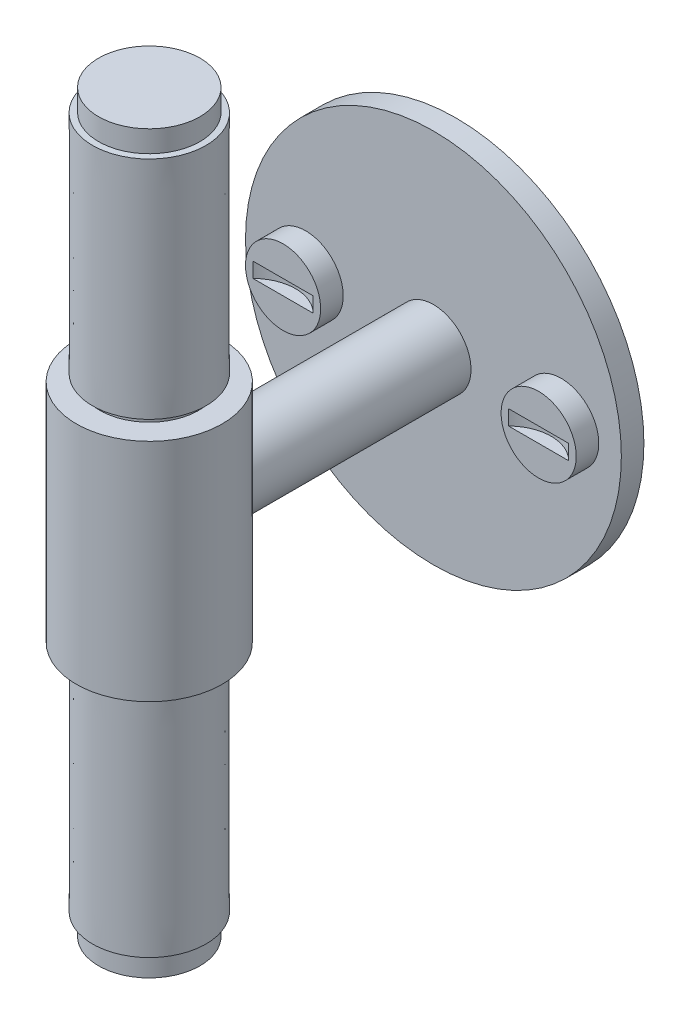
ISO-10303-21;
HEADER;
FILE_DESCRIPTION(('STEP AP214'),'2;1');
FILE_NAME('part.step','',(''),(''),'','','');
FILE_SCHEMA(('AUTOMOTIVE_DESIGN { 1 0 10303 214 1 1 1 1 }'));
ENDSEC;
DATA;
#1=APPLICATION_CONTEXT('core data for automotive mechanical design processes');
#2=APPLICATION_PROTOCOL_DEFINITION('international standard','automotive_design',2000,#1);
#3=PRODUCT_CONTEXT('',#1,'mechanical');
#4=PRODUCT('Part','Part','',(#3));
#5=PRODUCT_RELATED_PRODUCT_CATEGORY('part','',(#4));
#6=PRODUCT_DEFINITION_FORMATION('','',#4);
#7=PRODUCT_DEFINITION_CONTEXT('part definition',#1,'design');
#8=PRODUCT_DEFINITION('design','',#6,#7);
#9=PRODUCT_DEFINITION_SHAPE('','',#8);
#10=(LENGTH_UNIT() NAMED_UNIT(*) SI_UNIT(.MILLI.,.METRE.));
#11=(NAMED_UNIT(*) PLANE_ANGLE_UNIT() SI_UNIT($,.RADIAN.));
#12=(NAMED_UNIT(*) SI_UNIT($,.STERADIAN.) SOLID_ANGLE_UNIT());
#13=UNCERTAINTY_MEASURE_WITH_UNIT(LENGTH_MEASURE(1.E-05),#10,'distance_accuracy_value','');
#14=(GEOMETRIC_REPRESENTATION_CONTEXT(3) GLOBAL_UNCERTAINTY_ASSIGNED_CONTEXT((#13)) GLOBAL_UNIT_ASSIGNED_CONTEXT((#10,
#11,#12)) REPRESENTATION_CONTEXT('',''));
#15=CARTESIAN_POINT('',(0.,0.,0.));
#16=DIRECTION('',(0.,0.,1.));
#17=DIRECTION('',(1.,0.,0.));
#18=AXIS2_PLACEMENT_3D('',#15,#16,#17);
#19=CARTESIAN_POINT('',(0.,0.,-40.));
#20=DIRECTION('',(0.,0.,-1.));
#21=DIRECTION('',(-1.,0.,0.));
#22=AXIS2_PLACEMENT_3D('',#19,#20,#21);
#23=PLANE('',#22);
#24=CARTESIAN_POINT('',(-17.,0.,-40.));
#25=DIRECTION('',(0.,0.,-1.));
#26=DIRECTION('',(-1.,0.,0.));
#27=AXIS2_PLACEMENT_3D('',#24,#25,#26);
#28=CIRCLE('',#27,5.);
#29=CARTESIAN_POINT('',(-22.,0.,-40.));
#30=VERTEX_POINT('',#29);
#31=EDGE_CURVE('E89',#30,#30,#28,.T.);
#32=ORIENTED_EDGE('',*,*,#31,.T.);
#33=EDGE_LOOP('',(#32));
#34=FACE_BOUND('',#33,.T.);
#35=CARTESIAN_POINT('',(0.,0.,-40.));
#36=DIRECTION('',(0.,0.,-1.));
#37=DIRECTION('',(-1.,0.,0.));
#38=AXIS2_PLACEMENT_3D('',#35,#36,#37);
#39=CIRCLE('',#38,25.);
#40=CARTESIAN_POINT('',(-25.,0.,-40.));
#41=VERTEX_POINT('',#40);
#42=EDGE_CURVE('E110',#41,#41,#39,.T.);
#43=ORIENTED_EDGE('',*,*,#42,.F.);
#44=EDGE_LOOP('',(#43));
#45=FACE_BOUND('',#44,.T.);
#46=CARTESIAN_POINT('',(0.,0.,-40.));
#47=DIRECTION('',(0.,0.,-1.));
#48=DIRECTION('',(-1.,0.,0.));
#49=AXIS2_PLACEMENT_3D('',#46,#47,#48);
#50=CIRCLE('',#49,5.);
#51=CARTESIAN_POINT('',(-5.,0.,-40.));
#52=VERTEX_POINT('',#51);
#53=EDGE_CURVE('E114',#52,#52,#50,.F.);
#54=ORIENTED_EDGE('',*,*,#53,.F.);
#55=EDGE_LOOP('',(#54));
#56=FACE_BOUND('',#55,.T.);
#57=CARTESIAN_POINT('',(17.,0.,-40.));
#58=DIRECTION('',(0.,0.,-1.));
#59=DIRECTION('',(-1.,0.,0.));
#60=AXIS2_PLACEMENT_3D('',#57,#58,#59);
#61=CIRCLE('',#60,5.);
#62=CARTESIAN_POINT('',(12.,0.,-40.));
#63=VERTEX_POINT('',#62);
#64=EDGE_CURVE('E162',#63,#63,#61,.F.);
#65=ORIENTED_EDGE('',*,*,#64,.F.);
#66=EDGE_LOOP('',(#65));
#67=FACE_BOUND('',#66,.T.);
#68=ADVANCED_FACE('F34',(#34,#45,#56,#67),#23,.F.);
#69=CARTESIAN_POINT('',(-1.79320220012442E-11,48.9149894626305,-2.19986049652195));
#70=DIRECTION('',(-3.66595642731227E-13,1.,-5.47929757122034E-13));
#71=DIRECTION('',(0.,-5.47929757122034E-13,-1.));
#72=AXIS2_PLACEMENT_3D('',#69,#70,#71);
#73=CYLINDRICAL_SURFACE('',#72,6.75);
#74=CARTESIAN_POINT('',(-1.79320220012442E-11,48.9149894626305,-2.19986049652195));
#75=DIRECTION('',(-3.66595642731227E-13,1.,-5.47929757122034E-13));
#76=DIRECTION('',(0.,-5.47929757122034E-13,-1.));
#77=AXIS2_PLACEMENT_3D('',#74,#75,#76);
#78=CIRCLE('',#77,6.75);
#79=CARTESIAN_POINT('',(-1.79320220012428E-11,48.9149894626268,-8.94986049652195));
#80=VERTEX_POINT('',#79);
#81=EDGE_CURVE('E159',#80,#80,#78,.T.);
#82=ORIENTED_EDGE('',*,*,#81,.F.);
#83=EDGE_LOOP('',(#82));
#84=FACE_BOUND('',#83,.T.);
#85=CARTESIAN_POINT('',(-1.68780783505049E-11,46.0400408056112,-2.19986049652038));
#86=DIRECTION('',(-3.66595642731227E-13,1.,-5.47929757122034E-13));
#87=DIRECTION('',(0.,-5.47929757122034E-13,-1.));
#88=AXIS2_PLACEMENT_3D('',#85,#86,#87);
#89=CIRCLE('',#88,6.75);
#90=CARTESIAN_POINT('',(-1.68780783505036E-11,46.0400408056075,-8.94986049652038));
#91=VERTEX_POINT('',#90);
#92=EDGE_CURVE('E120',#91,#91,#89,.T.);
#93=ORIENTED_EDGE('',*,*,#92,.T.);
#94=EDGE_LOOP('',(#93));
#95=FACE_BOUND('',#94,.T.);
#96=ADVANCED_FACE('F36',(#84,#95),#73,.T.);
#97=CARTESIAN_POINT('',(-6.75000000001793,48.914989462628,-2.19986049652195));
#98=DIRECTION('',(3.66595642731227E-13,-1.,5.47929757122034E-13));
#99=DIRECTION('',(0.,5.47929757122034E-13,1.));
#100=AXIS2_PLACEMENT_3D('',#97,#98,#99);
#101=PLANE('',#100);
#102=ORIENTED_EDGE('',*,*,#81,.T.);
#103=EDGE_LOOP('',(#102));
#104=FACE_BOUND('',#103,.T.);
#105=ADVANCED_FACE('F212',(#104),#101,.F.);
#106=CARTESIAN_POINT('',(-6.74999999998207,-48.9149894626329,-2.19986049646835));
#107=DIRECTION('',(-3.66595642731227E-13,1.,-5.47929757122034E-13));
#108=DIRECTION('',(0.,-5.47929757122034E-13,-1.));
#109=AXIS2_PLACEMENT_3D('',#106,#107,#108);
#110=PLANE('',#109);
#111=CARTESIAN_POINT('',(1.79320220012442E-11,-48.9149894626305,-2.19986049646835));
#112=DIRECTION('',(-3.66595642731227E-13,1.,-5.47929757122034E-13));
#113=DIRECTION('',(0.,-5.47929757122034E-13,-1.));
#114=AXIS2_PLACEMENT_3D('',#111,#112,#113);
#115=CIRCLE('',#114,6.75);
#116=CARTESIAN_POINT('',(1.79320220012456E-11,-48.9149894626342,-8.94986049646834));
#117=VERTEX_POINT('',#116);
#118=EDGE_CURVE('E156',#117,#117,#115,.T.);
#119=ORIENTED_EDGE('',*,*,#118,.F.);
#120=EDGE_LOOP('',(#119));
#121=FACE_BOUND('',#120,.T.);
#122=ADVANCED_FACE('F332',(#121),#110,.F.);
#123=CARTESIAN_POINT('',(-1.79320220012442E-11,48.9149894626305,-2.19986049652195));
#124=DIRECTION('',(-3.66595642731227E-13,1.,-5.47929757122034E-13));
#125=DIRECTION('',(0.,-5.47929757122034E-13,-1.));
#126=AXIS2_PLACEMENT_3D('',#123,#124,#125);
#127=CYLINDRICAL_SURFACE('',#126,6.75);
#128=CARTESIAN_POINT('',(1.68780783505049E-11,-46.0400408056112,-2.19986049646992));
#129=DIRECTION('',(-3.66595642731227E-13,1.,-5.47929757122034E-13));
#130=DIRECTION('',(0.,-5.47929757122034E-13,-1.));
#131=AXIS2_PLACEMENT_3D('',#128,#129,#130);
#132=CIRCLE('',#131,6.75);
#133=CARTESIAN_POINT('',(1.68780783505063E-11,-46.0400408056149,-8.94986049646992));
#134=VERTEX_POINT('',#133);
#135=EDGE_CURVE('E153',#134,#134,#132,.T.);
#136=ORIENTED_EDGE('',*,*,#135,.F.);
#137=EDGE_LOOP('',(#136));
#138=FACE_BOUND('',#137,.T.);
#139=ORIENTED_EDGE('',*,*,#118,.T.);
#140=EDGE_LOOP('',(#139));
#141=FACE_BOUND('',#140,.T.);
#142=ADVANCED_FACE('F345',(#138,#141),#127,.T.);
#143=CARTESIAN_POINT('',(1.68780783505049E-11,-46.0400408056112,-2.19986049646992));
#144=DIRECTION('',(-3.66595642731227E-13,1.,-5.47929757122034E-13));
#145=DIRECTION('',(0.,-5.47929757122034E-13,-1.));
#146=AXIS2_PLACEMENT_3D('',#143,#144,#145);
#147=CONICAL_SURFACE('',#146,6.75,1.52072437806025);
#148=CARTESIAN_POINT('',(1.68633995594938E-11,-45.9999999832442,-2.19986049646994));
#149=DIRECTION('',(-3.66595642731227E-13,1.,-5.47929757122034E-13));
#150=DIRECTION('',(0.,-5.47929757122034E-13,-1.));
#151=AXIS2_PLACEMENT_3D('',#148,#149,#150);
#152=CIRCLE('',#151,7.54899732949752);
#153=CARTESIAN_POINT('',(1.68633995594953E-11,-45.9999999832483,-9.74885782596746));
#154=VERTEX_POINT('',#153);
#155=EDGE_CURVE('E150',#154,#154,#152,.T.);
#156=ORIENTED_EDGE('',*,*,#155,.F.);
#157=EDGE_LOOP('',(#156));
#158=FACE_BOUND('',#157,.T.);
#159=ORIENTED_EDGE('',*,*,#135,.T.);
#160=EDGE_LOOP('',(#159));
#161=FACE_BOUND('',#160,.T.);
#162=ADVANCED_FACE('F354',(#158,#161),#147,.T.);
#163=CARTESIAN_POINT('',(1.68633995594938E-11,-45.9999999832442,-2.19986049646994));
#164=DIRECTION('',(-3.66595642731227E-13,1.,-5.47929757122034E-13));
#165=DIRECTION('',(0.,-5.47929757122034E-13,-1.));
#166=AXIS2_PLACEMENT_3D('',#163,#164,#165);
#167=CONICAL_SURFACE('',#166,7.54899732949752,3.34223500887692E-05);
#168=CARTESIAN_POINT('',(5.86553028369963E-12,-16.,-2.19986049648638));
#169=DIRECTION('',(-3.66595642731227E-13,1.,-5.47929757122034E-13));
#170=DIRECTION('',(0.,-5.47929757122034E-13,-1.));
#171=AXIS2_PLACEMENT_3D('',#168,#169,#170);
#172=CIRCLE('',#171,7.55);
#173=CARTESIAN_POINT('',(5.86553028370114E-12,-16.0000000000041,-9.74986049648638));
#174=VERTEX_POINT('',#173);
#175=EDGE_CURVE('E147',#174,#174,#172,.T.);
#176=ORIENTED_EDGE('',*,*,#175,.F.);
#177=EDGE_LOOP('',(#176));
#178=FACE_BOUND('',#177,.T.);
#179=ORIENTED_EDGE('',*,*,#155,.T.);
#180=EDGE_LOOP('',(#179));
#181=FACE_BOUND('',#180,.T.);
#182=ADVANCED_FACE('F363',(#178,#181),#167,.T.);
#183=CARTESIAN_POINT('',(-6.59168378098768,-16.0000000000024,-2.19986049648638));
#184=DIRECTION('',(3.66595642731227E-13,-1.,5.47929757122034E-13));
#185=DIRECTION('',(0.,5.47929757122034E-13,1.));
#186=AXIS2_PLACEMENT_3D('',#183,#184,#185);
#187=PLANE('',#186);
#188=CARTESIAN_POINT('',(5.86553028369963E-12,-16.,-2.19986049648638));
#189=DIRECTION('',(-3.66595642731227E-13,1.,-5.47929757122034E-13));
#190=DIRECTION('',(0.,-5.47929757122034E-13,-1.));
#191=AXIS2_PLACEMENT_3D('',#188,#189,#190);
#192=CIRCLE('',#191,6.59168378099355);
#193=CARTESIAN_POINT('',(5.86553028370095E-12,-16.0000000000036,-8.79154427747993));
#194=VERTEX_POINT('',#193);
#195=EDGE_CURVE('E144',#194,#194,#192,.T.);
#196=ORIENTED_EDGE('',*,*,#195,.F.);
#197=EDGE_LOOP('',(#196));
#198=FACE_BOUND('',#197,.T.);
#199=ORIENTED_EDGE('',*,*,#175,.T.);
#200=EDGE_LOOP('',(#199));
#201=FACE_BOUND('',#200,.T.);
#202=ADVANCED_FACE('F372',(#198,#201),#187,.F.);
#203=CARTESIAN_POINT('',(-1.79320220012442E-11,48.9149894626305,-2.19986049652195));
#204=DIRECTION('',(-3.66595642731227E-13,1.,-5.47929757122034E-13));
#205=DIRECTION('',(0.,-5.47929757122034E-13,-1.));
#206=AXIS2_PLACEMENT_3D('',#203,#204,#205);
#207=CYLINDRICAL_SURFACE('',#206,6.59168378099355);
#208=CARTESIAN_POINT('',(5.4989346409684E-12,-15.,-2.19986049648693));
#209=DIRECTION('',(-3.66595642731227E-13,1.,-5.47929757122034E-13));
#210=DIRECTION('',(0.,-5.47929757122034E-13,-1.));
#211=AXIS2_PLACEMENT_3D('',#208,#209,#210);
#212=CIRCLE('',#211,6.59168378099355);
#213=CARTESIAN_POINT('',(5.49893464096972E-12,-15.0000000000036,-8.79154427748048));
#214=VERTEX_POINT('',#213);
#215=EDGE_CURVE('E141',#214,#214,#212,.T.);
#216=ORIENTED_EDGE('',*,*,#215,.F.);
#217=EDGE_LOOP('',(#216));
#218=FACE_BOUND('',#217,.T.);
#219=ORIENTED_EDGE('',*,*,#195,.T.);
#220=EDGE_LOOP('',(#219));
#221=FACE_BOUND('',#220,.T.);
#222=ADVANCED_FACE('F381',(#218,#221),#207,.T.);
#223=CARTESIAN_POINT('',(-9.70621149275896,-15.0000000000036,-2.19986049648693));
#224=DIRECTION('',(-3.66595642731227E-13,1.,-5.47929757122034E-13));
#225=DIRECTION('',(0.,-5.47929757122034E-13,-1.));
#226=AXIS2_PLACEMENT_3D('',#223,#224,#225);
#227=PLANE('',#226);
#228=CARTESIAN_POINT('',(5.4989346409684E-12,-15.,-2.19986049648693));
#229=DIRECTION('',(-3.66595642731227E-13,1.,-5.47929757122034E-13));
#230=DIRECTION('',(0.,-5.47929757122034E-13,-1.));
#231=AXIS2_PLACEMENT_3D('',#228,#229,#230);
#232=CIRCLE('',#231,9.70621149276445);
#233=CARTESIAN_POINT('',(5.49893464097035E-12,-15.0000000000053,-11.9060719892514));
#234=VERTEX_POINT('',#233);
#235=EDGE_CURVE('E138',#234,#234,#232,.T.);
#236=ORIENTED_EDGE('',*,*,#235,.F.);
#237=EDGE_LOOP('',(#236));
#238=FACE_BOUND('',#237,.T.);
#239=ORIENTED_EDGE('',*,*,#215,.T.);
#240=EDGE_LOOP('',(#239));
#241=FACE_BOUND('',#240,.T.);
#242=ADVANCED_FACE('F203',(#238,#241),#227,.F.);
#243=CARTESIAN_POINT('',(-1.79320220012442E-11,48.9149894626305,-2.19986049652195));
#244=DIRECTION('',(-3.66595642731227E-13,1.,-5.47929757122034E-13));
#245=DIRECTION('',(0.,-5.47929757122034E-13,-1.));
#246=AXIS2_PLACEMENT_3D('',#243,#244,#245);
#247=CYLINDRICAL_SURFACE('',#246,9.70621149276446);
#248=CARTESIAN_POINT('',(1.83297821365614E-12,-5.,-11.9060719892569));
#249=CARTESIAN_POINT('',(0.13100531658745,-4.99999995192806,-11.9060719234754));
#250=CARTESIAN_POINT('',(0.262012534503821,-4.99484565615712,-11.9034137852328));
#251=CARTESIAN_POINT('',(0.523055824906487,-4.97429009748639,-11.892849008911));
#252=CARTESIAN_POINT('',(0.653091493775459,-4.95888479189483,-11.8849403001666));
#253=CARTESIAN_POINT('',(0.911324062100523,-4.91798738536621,-11.864064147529));
#254=CARTESIAN_POINT('',(1.03951837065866,-4.89248228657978,-11.8510901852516));
#255=CARTESIAN_POINT('',(1.29303064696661,-4.83167397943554,-11.8204076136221));
#256=CARTESIAN_POINT('',(1.41834741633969,-4.79636676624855,-11.8026970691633));
#257=CARTESIAN_POINT('',(1.66468930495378,-4.71651318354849,-11.7630629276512));
#258=CARTESIAN_POINT('',(1.78573094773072,-4.67200834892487,-11.7411583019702));
#259=CARTESIAN_POINT('',(2.02341330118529,-4.57409461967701,-11.6935984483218));
#260=CARTESIAN_POINT('',(2.14005233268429,-4.52068236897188,-11.6679418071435));
#261=CARTESIAN_POINT('',(2.48228923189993,-4.34781107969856,-11.5862137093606));
#262=CARTESIAN_POINT('',(2.7004682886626,-4.21563183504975,-11.5253401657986));
#263=CARTESIAN_POINT('',(3.12571263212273,-3.91184515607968,-11.3918855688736));
#264=CARTESIAN_POINT('',(3.33120921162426,-3.73827684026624,-11.3188082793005));
#265=CARTESIAN_POINT('',(3.71164624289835,-3.36089122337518,-11.1706985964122));
#266=CARTESIAN_POINT('',(3.88656186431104,-3.15704958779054,-11.0956646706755));
#267=CARTESIAN_POINT('',(4.215609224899,-2.70428984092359,-10.9448387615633));
#268=CARTESIAN_POINT('',(4.36678154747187,-2.45302810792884,-10.8695076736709));
#269=CARTESIAN_POINT('',(4.55968693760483,-2.05691449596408,-10.7687038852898));
#270=CARTESIAN_POINT('',(4.61836039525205,-1.92162504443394,-10.7371263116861));
#271=CARTESIAN_POINT('',(4.72380841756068,-1.64543003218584,-10.6792350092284));
#272=CARTESIAN_POINT('',(4.77059021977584,-1.5045279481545,-10.6529180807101));
#273=CARTESIAN_POINT('',(4.84916498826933,-1.22684354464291,-10.608074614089));
#274=CARTESIAN_POINT('',(4.88169539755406,-1.09033029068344,-10.5891721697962));
#275=CARTESIAN_POINT('',(4.93522953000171,-0.814396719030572,-10.5577919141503));
#276=CARTESIAN_POINT('',(4.95623955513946,-0.674978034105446,-10.5453105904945));
#277=CARTESIAN_POINT('',(4.98640554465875,-0.394511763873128,-10.5273218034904));
#278=CARTESIAN_POINT('',(4.99556973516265,-0.253465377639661,-10.5218095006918));
#279=CARTESIAN_POINT('',(5.00191042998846,0.0289874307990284,-10.518000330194));
#280=CARTESIAN_POINT('',(4.99908820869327,0.170393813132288,-10.5197026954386));
#281=CARTESIAN_POINT('',(4.98264965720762,0.433956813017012,-10.5295552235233));
#282=CARTESIAN_POINT('',(4.97047561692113,0.556239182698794,-10.5368435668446));
#283=CARTESIAN_POINT('',(4.93723698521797,0.799205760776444,-10.5565707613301));
#284=CARTESIAN_POINT('',(4.91616962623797,0.919889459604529,-10.5690112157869));
#285=CARTESIAN_POINT('',(4.86539340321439,1.15881799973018,-10.5986312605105));
#286=CARTESIAN_POINT('',(4.83568534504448,1.27706306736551,-10.615810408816));
#287=CARTESIAN_POINT('',(4.76794521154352,1.51045915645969,-10.6543713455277));
#288=CARTESIAN_POINT('',(4.72990985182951,1.62560893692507,-10.6757547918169));
#289=CARTESIAN_POINT('',(4.60191677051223,1.97061999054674,-10.7463551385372));
#290=CARTESIAN_POINT('',(4.49921091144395,2.19472182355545,-10.8013219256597));
#291=CARTESIAN_POINT('',(4.26348005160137,2.62349851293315,-10.9205644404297));
#292=CARTESIAN_POINT('',(4.13044143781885,2.82816458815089,-10.9848443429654));
#293=CARTESIAN_POINT('',(3.81679986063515,3.24163270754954,-11.1260030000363));
#294=CARTESIAN_POINT('',(3.63219234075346,3.44722757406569,-11.2034077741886));
#295=CARTESIAN_POINT('',(3.2307720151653,3.82599180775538,-11.3551096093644));
#296=CARTESIAN_POINT('',(3.01394207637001,3.99914381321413,-11.4294049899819));
#297=CARTESIAN_POINT('',(2.66186945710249,4.23507535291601,-11.5348027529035));
#298=CARTESIAN_POINT('',(2.5365854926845,4.31130534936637,-11.5697049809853));
#299=CARTESIAN_POINT('',(2.27903336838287,4.45281554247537,-11.6356529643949));
#300=CARTESIAN_POINT('',(2.14676819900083,4.51810037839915,-11.6667003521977));
#301=CARTESIAN_POINT('',(1.87617011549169,4.63700570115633,-11.7240220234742));
#302=CARTESIAN_POINT('',(1.73783986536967,4.69063124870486,-11.7502983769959));
#303=CARTESIAN_POINT('',(1.45610540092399,4.78558707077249,-11.797291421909));
#304=CARTESIAN_POINT('',(1.31270181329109,4.82691885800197,-11.8180087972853));
#305=CARTESIAN_POINT('',(1.03456974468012,4.89370257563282,-11.8517054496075));
#306=CARTESIAN_POINT('',(0.900157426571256,4.92021536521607,-11.865197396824));
#307=CARTESIAN_POINT('',(0.62917939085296,4.9621491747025,-11.8866112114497));
#308=CARTESIAN_POINT('',(0.492613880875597,4.97757125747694,-11.8945336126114));
#309=CARTESIAN_POINT('',(0.218521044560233,4.99711104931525,-11.9045804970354));
#310=CARTESIAN_POINT('',(0.0809941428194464,5.00123346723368,-11.9067073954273));
#311=CARTESIAN_POINT('',(-0.19389391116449,4.99812919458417,-11.9051082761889));
#312=CARTESIAN_POINT('',(-0.331255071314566,4.99090306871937,-11.9013825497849));
#313=CARTESIAN_POINT('',(-0.593190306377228,4.96628186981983,-11.8887406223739));
#314=CARTESIAN_POINT('',(-0.71787270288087,4.94978816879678,-11.8802847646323));
#315=CARTESIAN_POINT('',(-0.965291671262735,4.90754198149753,-11.8587517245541));
#316=CARTESIAN_POINT('',(-1.08802761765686,4.88178657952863,-11.8456730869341));
#317=CARTESIAN_POINT('',(-1.33067963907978,4.82129825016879,-11.8152010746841));
#318=CARTESIAN_POINT('',(-1.45059657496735,4.78656810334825,-11.7978090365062));
#319=CARTESIAN_POINT('',(-1.68695075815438,4.70847253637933,-11.7591028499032));
#320=CARTESIAN_POINT('',(-1.80338665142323,4.6651038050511,-11.7377871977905));
#321=CARTESIAN_POINT('',(-2.15259473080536,4.52005282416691,-11.6673877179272));
#322=CARTESIAN_POINT('',(-2.37886272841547,4.40502875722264,-11.6126858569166));
#323=CARTESIAN_POINT('',(-2.80947787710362,4.14372096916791,-11.4932717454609));
#324=CARTESIAN_POINT('',(-3.01381593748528,3.99742435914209,-11.4285553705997));
#325=CARTESIAN_POINT('',(-3.4171833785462,3.66044126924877,-11.2874108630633));
#326=CARTESIAN_POINT('',(-3.61351510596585,3.46673982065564,-11.2104624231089));
#327=CARTESIAN_POINT('',(-3.9722479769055,3.04910228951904,-11.0581803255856));
#328=CARTESIAN_POINT('',(-4.13462206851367,2.82514233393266,-10.9828479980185));
#329=CARTESIAN_POINT('',(-4.35366432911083,2.46314062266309,-10.8753027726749));
#330=CARTESIAN_POINT('',(-4.42409851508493,2.33431553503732,-10.8394925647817));
#331=CARTESIAN_POINT('',(-4.55369955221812,2.07013016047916,-10.7718904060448));
#332=CARTESIAN_POINT('',(-4.61287150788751,1.93477286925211,-10.7400966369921));
#333=CARTESIAN_POINT('',(-4.71925397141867,1.6584755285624,-10.6817746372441));
#334=CARTESIAN_POINT('',(-4.76647486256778,1.51754044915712,-10.6552418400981));
#335=CARTESIAN_POINT('',(-4.84837275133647,1.23104197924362,-10.6085495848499));
#336=CARTESIAN_POINT('',(-4.88305183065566,1.08547936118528,-10.5883890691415));
#337=CARTESIAN_POINT('',(-4.93656476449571,0.805378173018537,-10.5569972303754));
#338=CARTESIAN_POINT('',(-4.95661308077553,0.671147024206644,-10.5450873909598));
#339=CARTESIAN_POINT('',(-4.98573607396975,0.401090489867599,-10.5277214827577));
#340=CARTESIAN_POINT('',(-4.99481206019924,0.265265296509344,-10.522264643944));
#341=CARTESIAN_POINT('',(-5.0018450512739,-0.00671820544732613,-10.5180396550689));
#342=CARTESIAN_POINT('',(-4.99980681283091,-0.142876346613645,-10.5192686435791));
#343=CARTESIAN_POINT('',(-4.98465634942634,-0.414344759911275,-10.5283549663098));
#344=CARTESIAN_POINT('',(-4.97154469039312,-0.549655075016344,-10.5362119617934));
#345=CARTESIAN_POINT('',(-4.93644276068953,-0.803857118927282,-10.5570394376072));
#346=CARTESIAN_POINT('',(-4.91555381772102,-0.922955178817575,-10.5693721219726));
#347=CARTESIAN_POINT('',(-4.86536120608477,-1.1587992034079,-10.5986483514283));
#348=CARTESIAN_POINT('',(-4.83605496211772,-1.2755444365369,-10.6155933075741));
#349=CARTESIAN_POINT('',(-4.73594622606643,-1.62119085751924,-10.6725998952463));
#350=CARTESIAN_POINT('',(-4.65293188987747,-1.84565773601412,-10.7188469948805));
#351=CARTESIAN_POINT('',(-4.45067690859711,-2.29252677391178,-10.8263257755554));
#352=CARTESIAN_POINT('',(-4.32939525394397,-2.51380015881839,-10.8883490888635));
#353=CARTESIAN_POINT('',(-4.05616030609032,-2.93436081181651,-11.0192165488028));
#354=CARTESIAN_POINT('',(-3.90419064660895,-3.133636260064,-11.0880643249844));
#355=CARTESIAN_POINT('',(-3.55051354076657,-3.53183286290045,-11.2356659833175));
#356=CARTESIAN_POINT('',(-3.34489068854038,-3.72724638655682,-11.3145296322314));
#357=CARTESIAN_POINT('',(-2.90163925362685,-4.08177810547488,-11.4651540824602));
#358=CARTESIAN_POINT('',(-2.66399215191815,-4.24087515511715,-11.5369107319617));
#359=CARTESIAN_POINT('',(-2.28589368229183,-4.44925647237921,-11.6339804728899));
#360=CARTESIAN_POINT('',(-2.15517836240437,-4.51404651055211,-11.6647686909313));
#361=CARTESIAN_POINT('',(-1.88775575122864,-4.63224693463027,-11.7217068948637));
#362=CARTESIAN_POINT('',(-1.7510514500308,-4.6856629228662,-11.747859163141));
#363=CARTESIAN_POINT('',(-1.47293357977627,-4.78037746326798,-11.7946956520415));
#364=CARTESIAN_POINT('',(-1.3315306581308,-4.82170157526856,-11.8153913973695));
#365=CARTESIAN_POINT('',(-1.04497739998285,-4.89180497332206,-11.8507349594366));
#366=CARTESIAN_POINT('',(-0.899829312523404,-4.92059161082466,-11.8653863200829));
#367=CARTESIAN_POINT('',(-0.629077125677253,-4.96186443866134,-11.8864687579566));
#368=CARTESIAN_POINT('',(-0.503814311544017,-4.97615024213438,-11.8938043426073));
#369=CARTESIAN_POINT('',(-0.25236826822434,-4.99521816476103,-11.9036060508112));
#370=CARTESIAN_POINT('',(-0.126185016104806,-5.00000004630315,-11.9060720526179));
#371=CARTESIAN_POINT('',(1.83297821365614E-12,-5.,-11.9060719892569));
#372=B_SPLINE_CURVE_WITH_KNOTS('',3,(#248,#249,#250,#251,#252,#253,#254,#255,#256,#257,#258,
#259,#260,#261,#262,#263,#264,#265,#266,#267,#268,#269,#270,#271,#272,#273,#274,#275,#276,#277,
#278,#279,#280,#281,#282,#283,#284,#285,#286,#287,#288,#289,#290,#291,#292,#293,#294,#295,#296,
#297,#298,#299,#300,#301,#302,#303,#304,#305,#306,#307,#308,#309,#310,#311,#312,#313,#314,#315,
#316,#317,#318,#319,#320,#321,#322,#323,#324,#325,#326,#327,#328,#329,#330,#331,#332,#333,#334,
#335,#336,#337,#338,#339,#340,#341,#342,#343,#344,#345,#346,#347,#348,#349,#350,#351,#352,#353,
#354,#355,#356,#357,#358,#359,#360,#361,#362,#363,#364,#365,#366,#367,#368,#369,#370,#371),
.UNSPECIFIED.,.T.,.F.,(4,2,2,2,2,2,2,2,2,2,2,2,2,2,2,2,2,2,2,2,2,2,2,2,2,2,2,2,2,2,2,2,2,2,2,2,
2,2,2,2,2,2,2,2,2,2,2,2,2,2,2,2,2,2,2,2,2,2,2,2,2,4),(0.,0.39289183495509,0.785938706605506,
1.17949305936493,1.57320844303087,1.96518327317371,2.35730612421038,3.14072574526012,
3.97355328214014,4.80705392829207,5.71022532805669,6.16211097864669,6.61372093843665,
7.03791876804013,7.46188431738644,7.88555529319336,8.30918122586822,8.67805334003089,
9.04704033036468,9.41599291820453,9.7850912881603,10.5395646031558,11.2943771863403,
12.1516120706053,13.0093043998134,13.4610421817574,13.9125880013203,14.3639374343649,
14.8152313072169,15.2276685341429,15.6400662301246,16.0522920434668,16.4644973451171,
16.84221529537,17.220052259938,17.5977723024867,17.9756374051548,18.7511044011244,
19.526891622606,20.3823068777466,21.2384010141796,21.6912704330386,22.1439341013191,
22.59620312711,23.048397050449,23.4565408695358,23.8646359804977,24.2725564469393,
24.6804560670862,25.0446685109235,25.4089925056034,26.1371746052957,26.913753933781,
27.6907485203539,28.5701403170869,29.4500428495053,29.8968367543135,30.3434100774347,
30.7890324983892,31.2343932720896,31.612819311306,31.9912548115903),.UNSPECIFIED.);
#373=CARTESIAN_POINT('',(1.83297821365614E-12,-5.,-11.9060719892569));
#374=VERTEX_POINT('',#373);
#375=EDGE_CURVE('E119',#374,#374,#372,.T.);
#376=ORIENTED_EDGE('',*,*,#375,.T.);
#377=EDGE_LOOP('',(#376));
#378=FACE_BOUND('',#377,.T.);
#379=CARTESIAN_POINT('',(-5.4989346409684E-12,15.,-2.19986049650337));
#380=DIRECTION('',(-3.66595642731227E-13,1.,-5.47929757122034E-13));
#381=DIRECTION('',(0.,-5.47929757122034E-13,-1.));
#382=AXIS2_PLACEMENT_3D('',#379,#380,#381);
#383=CIRCLE('',#382,9.70621149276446);
#384=CARTESIAN_POINT('',(-5.49893464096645E-12,14.9999999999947,-11.9060719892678));
#385=VERTEX_POINT('',#384);
#386=EDGE_CURVE('E135',#385,#385,#383,.T.);
#387=ORIENTED_EDGE('',*,*,#386,.F.);
#388=EDGE_LOOP('',(#387));
#389=FACE_BOUND('',#388,.T.);
#390=ORIENTED_EDGE('',*,*,#235,.T.);
#391=EDGE_LOOP('',(#390));
#392=FACE_BOUND('',#391,.T.);
#393=ADVANCED_FACE('F170',(#378,#389,#392),#247,.T.);
#394=CARTESIAN_POINT('',(-9.70621149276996,14.9999999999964,-2.19986049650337));
#395=DIRECTION('',(3.66595642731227E-13,-1.,5.47929757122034E-13));
#396=DIRECTION('',(0.,5.47929757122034E-13,1.));
#397=AXIS2_PLACEMENT_3D('',#394,#395,#396);
#398=PLANE('',#397);
#399=CARTESIAN_POINT('',(-5.4989346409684E-12,15.,-2.19986049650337));
#400=DIRECTION('',(-3.66595642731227E-13,1.,-5.47929757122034E-13));
#401=DIRECTION('',(0.,-5.47929757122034E-13,-1.));
#402=AXIS2_PLACEMENT_3D('',#399,#400,#401);
#403=CIRCLE('',#402,6.59168378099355);
#404=CARTESIAN_POINT('',(-5.49893464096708E-12,14.9999999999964,-8.79154427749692));
#405=VERTEX_POINT('',#404);
#406=EDGE_CURVE('E132',#405,#405,#403,.T.);
#407=ORIENTED_EDGE('',*,*,#406,.F.);
#408=EDGE_LOOP('',(#407));
#409=FACE_BOUND('',#408,.T.);
#410=ORIENTED_EDGE('',*,*,#386,.T.);
#411=EDGE_LOOP('',(#410));
#412=FACE_BOUND('',#411,.T.);
#413=ADVANCED_FACE('F196',(#409,#412),#398,.F.);
#414=CARTESIAN_POINT('',(-1.79320220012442E-11,48.9149894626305,-2.19986049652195));
#415=DIRECTION('',(-3.66595642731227E-13,1.,-5.47929757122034E-13));
#416=DIRECTION('',(0.,-5.47929757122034E-13,-1.));
#417=AXIS2_PLACEMENT_3D('',#414,#415,#416);
#418=CYLINDRICAL_SURFACE('',#417,6.59168378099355);
#419=CARTESIAN_POINT('',(-5.86553028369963E-12,16.,-2.19986049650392));
#420=DIRECTION('',(-3.66595642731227E-13,1.,-5.47929757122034E-13));
#421=DIRECTION('',(0.,-5.47929757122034E-13,-1.));
#422=AXIS2_PLACEMENT_3D('',#419,#420,#421);
#423=CIRCLE('',#422,6.59168378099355);
#424=CARTESIAN_POINT('',(-5.8655302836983E-12,15.9999999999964,-8.79154427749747));
#425=VERTEX_POINT('',#424);
#426=EDGE_CURVE('E129',#425,#425,#423,.T.);
#427=ORIENTED_EDGE('',*,*,#426,.F.);
#428=EDGE_LOOP('',(#427));
#429=FACE_BOUND('',#428,.T.);
#430=ORIENTED_EDGE('',*,*,#406,.T.);
#431=EDGE_LOOP('',(#430));
#432=FACE_BOUND('',#431,.T.);
#433=ADVANCED_FACE('F193',(#429,#432),#418,.T.);
#434=CARTESIAN_POINT('',(-6.59168378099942,15.9999999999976,-2.19986049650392));
#435=DIRECTION('',(-3.66595642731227E-13,1.,-5.47929757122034E-13));
#436=DIRECTION('',(0.,-5.47929757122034E-13,-1.));
#437=AXIS2_PLACEMENT_3D('',#434,#435,#436);
#438=PLANE('',#437);
#439=CARTESIAN_POINT('',(-5.86553028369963E-12,16.,-2.19986049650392));
#440=DIRECTION('',(-3.66595642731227E-13,1.,-5.47929757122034E-13));
#441=DIRECTION('',(0.,-5.47929757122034E-13,-1.));
#442=AXIS2_PLACEMENT_3D('',#439,#440,#441);
#443=CIRCLE('',#442,7.55);
#444=CARTESIAN_POINT('',(-5.86553028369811E-12,15.9999999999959,-9.74986049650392));
#445=VERTEX_POINT('',#444);
#446=EDGE_CURVE('E126',#445,#445,#443,.T.);
#447=ORIENTED_EDGE('',*,*,#446,.F.);
#448=EDGE_LOOP('',(#447));
#449=FACE_BOUND('',#448,.T.);
#450=ORIENTED_EDGE('',*,*,#426,.T.);
#451=EDGE_LOOP('',(#450));
#452=FACE_BOUND('',#451,.T.);
#453=ADVANCED_FACE('F189',(#449,#452),#438,.F.);
#454=CARTESIAN_POINT('',(-5.86553028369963E-12,16.,-2.19986049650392));
#455=DIRECTION('',(3.66595642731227E-13,-1.,5.47929757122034E-13));
#456=DIRECTION('',(0.,5.47929757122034E-13,1.));
#457=AXIS2_PLACEMENT_3D('',#454,#455,#456);
#458=CONICAL_SURFACE('',#457,7.55,3.34223500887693E-05);
#459=CARTESIAN_POINT('',(-1.68633995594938E-11,45.9999999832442,-2.19986049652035));
#460=DIRECTION('',(-3.66595642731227E-13,1.,-5.47929757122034E-13));
#461=DIRECTION('',(0.,-5.47929757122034E-13,-1.));
#462=AXIS2_PLACEMENT_3D('',#459,#460,#461);
#463=CIRCLE('',#462,7.54899732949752);
#464=CARTESIAN_POINT('',(-1.68633995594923E-11,45.9999999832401,-9.74885782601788));
#465=VERTEX_POINT('',#464);
#466=EDGE_CURVE('E123',#465,#465,#463,.T.);
#467=ORIENTED_EDGE('',*,*,#466,.F.);
#468=EDGE_LOOP('',(#467));
#469=FACE_BOUND('',#468,.T.);
#470=ORIENTED_EDGE('',*,*,#446,.T.);
#471=EDGE_LOOP('',(#470));
#472=FACE_BOUND('',#471,.T.);
#473=ADVANCED_FACE('F185',(#469,#472),#458,.T.);
#474=CARTESIAN_POINT('',(-1.68633995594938E-11,45.9999999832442,-2.19986049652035));
#475=DIRECTION('',(3.66595642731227E-13,-1.,5.47929757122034E-13));
#476=DIRECTION('',(0.,5.47929757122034E-13,1.));
#477=AXIS2_PLACEMENT_3D('',#474,#475,#476);
#478=CONICAL_SURFACE('',#477,7.54899732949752,1.52072437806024);
#479=ORIENTED_EDGE('',*,*,#92,.F.);
#480=EDGE_LOOP('',(#479));
#481=FACE_BOUND('',#480,.T.);
#482=ORIENTED_EDGE('',*,*,#466,.T.);
#483=EDGE_LOOP('',(#482));
#484=FACE_BOUND('',#483,.T.);
#485=ADVANCED_FACE('F180',(#481,#484),#478,.T.);
#486=CARTESIAN_POINT('',(0.,0.,-40.));
#487=DIRECTION('',(0.,0.,1.));
#488=DIRECTION('',(1.,0.,0.));
#489=AXIS2_PLACEMENT_3D('',#486,#487,#488);
#490=CYLINDRICAL_SURFACE('',#489,5.);
#491=ORIENTED_EDGE('',*,*,#53,.T.);
#492=EDGE_LOOP('',(#491));
#493=FACE_BOUND('',#492,.T.);
#494=ORIENTED_EDGE('',*,*,#375,.F.);
#495=EDGE_LOOP('',(#494));
#496=FACE_BOUND('',#495,.T.);
#497=ADVANCED_FACE('F174',(#493,#496),#490,.T.);
#498=CARTESIAN_POINT('',(0.,0.,-43.));
#499=DIRECTION('',(0.,0.,1.));
#500=DIRECTION('',(1.,0.,0.));
#501=AXIS2_PLACEMENT_3D('',#498,#499,#500);
#502=CYLINDRICAL_SURFACE('',#501,25.);
#503=CARTESIAN_POINT('',(0.,0.,-43.));
#504=DIRECTION('',(0.,0.,-1.));
#505=DIRECTION('',(-1.,0.,0.));
#506=AXIS2_PLACEMENT_3D('',#503,#504,#505);
#507=CIRCLE('',#506,25.);
#508=CARTESIAN_POINT('',(-25.,0.,-43.));
#509=VERTEX_POINT('',#508);
#510=EDGE_CURVE('E111',#509,#509,#507,.T.);
#511=ORIENTED_EDGE('',*,*,#510,.F.);
#512=EDGE_LOOP('',(#511));
#513=FACE_BOUND('',#512,.T.);
#514=ORIENTED_EDGE('',*,*,#42,.T.);
#515=EDGE_LOOP('',(#514));
#516=FACE_BOUND('',#515,.T.);
#517=ADVANCED_FACE('F179',(#513,#516),#502,.T.);
#518=CARTESIAN_POINT('',(0.,0.,-43.));
#519=DIRECTION('',(0.,0.,-1.));
#520=DIRECTION('',(-1.,0.,0.));
#521=AXIS2_PLACEMENT_3D('',#518,#519,#520);
#522=PLANE('',#521);
#523=ORIENTED_EDGE('',*,*,#510,.T.);
#524=EDGE_LOOP('',(#523));
#525=FACE_BOUND('',#524,.T.);
#526=ADVANCED_FACE('F216',(#525),#522,.T.);
#527=CARTESIAN_POINT('',(17.,0.,-37.));
#528=DIRECTION('',(0.,0.,-1.));
#529=DIRECTION('',(-1.,0.,0.));
#530=AXIS2_PLACEMENT_3D('',#527,#528,#529);
#531=CYLINDRICAL_SURFACE('',#530,5.);
#532=CARTESIAN_POINT('',(17.,0.,-37.));
#533=DIRECTION('',(0.,0.,1.));
#534=DIRECTION('',(1.,0.,0.));
#535=AXIS2_PLACEMENT_3D('',#532,#533,#534);
#536=CIRCLE('',#535,5.);
#537=CARTESIAN_POINT('',(22.,0.,-37.));
#538=VERTEX_POINT('',#537);
#539=EDGE_CURVE('E105',#538,#538,#536,.T.);
#540=ORIENTED_EDGE('',*,*,#539,.F.);
#541=EDGE_LOOP('',(#540));
#542=FACE_BOUND('',#541,.T.);
#543=ORIENTED_EDGE('',*,*,#64,.T.);
#544=EDGE_LOOP('',(#543));
#545=FACE_BOUND('',#544,.T.);
#546=ADVANCED_FACE('F219',(#542,#545),#531,.T.);
#547=CARTESIAN_POINT('',(17.,0.,-37.));
#548=DIRECTION('',(0.,0.,1.));
#549=DIRECTION('',(1.,0.,0.));
#550=AXIS2_PLACEMENT_3D('',#547,#548,#549);
#551=PLANE('',#550);
#552=DIRECTION('',(1.,0.,0.));
#553=VECTOR('',#552,1.);
#554=CARTESIAN_POINT('',(17.,-1.,-37.));
#555=LINE('',#554,#553);
#556=CARTESIAN_POINT('',(13.,-1.,-37.));
#557=VERTEX_POINT('',#556);
#558=CARTESIAN_POINT('',(21.,-1.,-37.));
#559=VERTEX_POINT('',#558);
#560=EDGE_CURVE('E486',#557,#559,#555,.T.);
#561=ORIENTED_EDGE('',*,*,#560,.F.);
#562=DIRECTION('',(0.,1.,0.));
#563=VECTOR('',#562,1.);
#564=CARTESIAN_POINT('',(13.,-1.,-37.));
#565=LINE('',#564,#563);
#566=CARTESIAN_POINT('',(13.,1.,-37.));
#567=VERTEX_POINT('',#566);
#568=EDGE_CURVE('E101',#557,#567,#565,.T.);
#569=ORIENTED_EDGE('',*,*,#568,.T.);
#570=DIRECTION('',(1.,0.,0.));
#571=VECTOR('',#570,1.);
#572=CARTESIAN_POINT('',(17.,1.,-37.));
#573=LINE('',#572,#571);
#574=CARTESIAN_POINT('',(21.,1.,-37.));
#575=VERTEX_POINT('',#574);
#576=EDGE_CURVE('E484',#567,#575,#573,.T.);
#577=ORIENTED_EDGE('',*,*,#576,.T.);
#578=DIRECTION('',(0.,1.,0.));
#579=VECTOR('',#578,1.);
#580=CARTESIAN_POINT('',(21.,-1.,-37.));
#581=LINE('',#580,#579);
#582=EDGE_CURVE('E103',#559,#575,#581,.T.);
#583=ORIENTED_EDGE('',*,*,#582,.F.);
#584=EDGE_LOOP('',(#561,#569,#577,#583));
#585=FACE_BOUND('',#584,.T.);
#586=ORIENTED_EDGE('',*,*,#539,.T.);
#587=EDGE_LOOP('',(#586));
#588=FACE_BOUND('',#587,.T.);
#589=ADVANCED_FACE('F223',(#585,#588),#551,.T.);
#590=CARTESIAN_POINT('',(17.,-1.,-33.));
#591=DIRECTION('',(0.,1.,0.));
#592=DIRECTION('',(0.,0.,1.));
#593=AXIS2_PLACEMENT_3D('',#590,#591,#592);
#594=CYLINDRICAL_SURFACE('',#593,5.65685424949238);
#595=CARTESIAN_POINT('',(17.,1.,-33.));
#596=DIRECTION('',(0.,1.,0.));
#597=DIRECTION('',(0.,0.,-1.));
#598=AXIS2_PLACEMENT_3D('',#595,#596,#597);
#599=CIRCLE('',#598,5.65685424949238);
#600=EDGE_CURVE('E55',#575,#567,#599,.T.);
#601=ORIENTED_EDGE('',*,*,#600,.T.);
#602=ORIENTED_EDGE('',*,*,#568,.F.);
#603=CARTESIAN_POINT('',(17.,-1.,-33.));
#604=DIRECTION('',(0.,1.,0.));
#605=DIRECTION('',(0.,0.,-1.));
#606=AXIS2_PLACEMENT_3D('',#603,#604,#605);
#607=CIRCLE('',#606,5.65685424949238);
#608=EDGE_CURVE('E98',#559,#557,#607,.T.);
#609=ORIENTED_EDGE('',*,*,#608,.F.);
#610=ORIENTED_EDGE('',*,*,#582,.T.);
#611=EDGE_LOOP('',(#601,#602,#609,#610));
#612=FACE_BOUND('',#611,.T.);
#613=ADVANCED_FACE('F227',(#612),#594,.F.);
#614=CARTESIAN_POINT('',(17.,-1.,-33.));
#615=DIRECTION('',(0.,-1.,0.));
#616=DIRECTION('',(0.,0.,-1.));
#617=AXIS2_PLACEMENT_3D('',#614,#615,#616);
#618=PLANE('',#617);
#619=ORIENTED_EDGE('',*,*,#560,.T.);
#620=ORIENTED_EDGE('',*,*,#608,.T.);
#621=EDGE_LOOP('',(#619,#620));
#622=FACE_BOUND('',#621,.T.);
#623=ADVANCED_FACE('F231',(#622),#618,.F.);
#624=CARTESIAN_POINT('',(17.,1.,-33.));
#625=DIRECTION('',(0.,-1.,0.));
#626=DIRECTION('',(0.,0.,-1.));
#627=AXIS2_PLACEMENT_3D('',#624,#625,#626);
#628=PLANE('',#627);
#629=ORIENTED_EDGE('',*,*,#600,.F.);
#630=ORIENTED_EDGE('',*,*,#576,.F.);
#631=EDGE_LOOP('',(#629,#630));
#632=FACE_BOUND('',#631,.T.);
#633=ADVANCED_FACE('F233',(#632),#628,.T.);
#634=CARTESIAN_POINT('',(-17.,0.,-37.));
#635=DIRECTION('',(0.,0.,-1.));
#636=DIRECTION('',(-1.,0.,0.));
#637=AXIS2_PLACEMENT_3D('',#634,#635,#636);
#638=CYLINDRICAL_SURFACE('',#637,5.);
#639=CARTESIAN_POINT('',(-17.,0.,-37.));
#640=DIRECTION('',(0.,0.,-1.));
#641=DIRECTION('',(-1.,0.,0.));
#642=AXIS2_PLACEMENT_3D('',#639,#640,#641);
#643=CIRCLE('',#642,5.);
#644=CARTESIAN_POINT('',(-22.,0.,-37.));
#645=VERTEX_POINT('',#644);
#646=EDGE_CURVE('E92',#645,#645,#643,.T.);
#647=ORIENTED_EDGE('',*,*,#646,.T.);
#648=EDGE_LOOP('',(#647));
#649=FACE_BOUND('',#648,.T.);
#650=ORIENTED_EDGE('',*,*,#31,.F.);
#651=EDGE_LOOP('',(#650));
#652=FACE_BOUND('',#651,.T.);
#653=ADVANCED_FACE('F236',(#649,#652),#638,.T.);
#654=CARTESIAN_POINT('',(-17.,0.,-37.));
#655=DIRECTION('',(0.,0.,1.));
#656=DIRECTION('',(-1.,0.,0.));
#657=AXIS2_PLACEMENT_3D('',#654,#655,#656);
#658=PLANE('',#657);
#659=DIRECTION('',(1.,0.,0.));
#660=VECTOR('',#659,1.);
#661=CARTESIAN_POINT('',(-17.,-1.,-37.));
#662=LINE('',#661,#660);
#663=CARTESIAN_POINT('',(-21.,-1.,-37.));
#664=VERTEX_POINT('',#663);
#665=CARTESIAN_POINT('',(-13.,-1.,-37.));
#666=VERTEX_POINT('',#665);
#667=EDGE_CURVE('E11',#664,#666,#662,.T.);
#668=ORIENTED_EDGE('',*,*,#667,.F.);
#669=DIRECTION('',(0.,1.,0.));
#670=VECTOR('',#669,1.);
#671=CARTESIAN_POINT('',(-21.,-1.,-37.));
#672=LINE('',#671,#670);
#673=CARTESIAN_POINT('',(-21.,1.,-37.));
#674=VERTEX_POINT('',#673);
#675=EDGE_CURVE('E74',#664,#674,#672,.T.);
#676=ORIENTED_EDGE('',*,*,#675,.T.);
#677=DIRECTION('',(1.,0.,0.));
#678=VECTOR('',#677,1.);
#679=CARTESIAN_POINT('',(-17.,1.,-37.));
#680=LINE('',#679,#678);
#681=CARTESIAN_POINT('',(-13.,1.,-37.));
#682=VERTEX_POINT('',#681);
#683=EDGE_CURVE('E42',#674,#682,#680,.T.);
#684=ORIENTED_EDGE('',*,*,#683,.T.);
#685=DIRECTION('',(0.,1.,0.));
#686=VECTOR('',#685,1.);
#687=CARTESIAN_POINT('',(-13.,-1.,-37.));
#688=LINE('',#687,#686);
#689=EDGE_CURVE('E82',#666,#682,#688,.T.);
#690=ORIENTED_EDGE('',*,*,#689,.F.);
#691=EDGE_LOOP('',(#668,#676,#684,#690));
#692=FACE_BOUND('',#691,.T.);
#693=ORIENTED_EDGE('',*,*,#646,.F.);
#694=EDGE_LOOP('',(#693));
#695=FACE_BOUND('',#694,.T.);
#696=ADVANCED_FACE('F87',(#692,#695),#658,.T.);
#697=CARTESIAN_POINT('',(-17.,-1.,-33.));
#698=DIRECTION('',(0.,1.,0.));
#699=DIRECTION('',(0.,0.,1.));
#700=AXIS2_PLACEMENT_3D('',#697,#698,#699);
#701=CYLINDRICAL_SURFACE('',#700,5.65685424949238);
#702=CARTESIAN_POINT('',(-17.,1.,-33.));
#703=DIRECTION('',(0.,-1.,0.));
#704=DIRECTION('',(0.,0.,-1.));
#705=AXIS2_PLACEMENT_3D('',#702,#703,#704);
#706=CIRCLE('',#705,5.65685424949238);
#707=EDGE_CURVE('E48',#674,#682,#706,.T.);
#708=ORIENTED_EDGE('',*,*,#707,.F.);
#709=ORIENTED_EDGE('',*,*,#675,.F.);
#710=CARTESIAN_POINT('',(-17.,-1.,-33.));
#711=DIRECTION('',(0.,-1.,0.));
#712=DIRECTION('',(0.,0.,-1.));
#713=AXIS2_PLACEMENT_3D('',#710,#711,#712);
#714=CIRCLE('',#713,5.65685424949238);
#715=EDGE_CURVE('E77',#664,#666,#714,.T.);
#716=ORIENTED_EDGE('',*,*,#715,.T.);
#717=ORIENTED_EDGE('',*,*,#689,.T.);
#718=EDGE_LOOP('',(#708,#709,#716,#717));
#719=FACE_BOUND('',#718,.T.);
#720=ADVANCED_FACE('F76',(#719),#701,.F.);
#721=CARTESIAN_POINT('',(-17.,-1.,-33.));
#722=DIRECTION('',(0.,-1.,0.));
#723=DIRECTION('',(0.,0.,-1.));
#724=AXIS2_PLACEMENT_3D('',#721,#722,#723);
#725=PLANE('',#724);
#726=ORIENTED_EDGE('',*,*,#667,.T.);
#727=ORIENTED_EDGE('',*,*,#715,.F.);
#728=EDGE_LOOP('',(#726,#727));
#729=FACE_BOUND('',#728,.T.);
#730=ADVANCED_FACE('F85',(#729),#725,.F.);
#731=CARTESIAN_POINT('',(-17.,1.,-33.));
#732=DIRECTION('',(0.,-1.,0.));
#733=DIRECTION('',(0.,0.,-1.));
#734=AXIS2_PLACEMENT_3D('',#731,#732,#733);
#735=PLANE('',#734);
#736=ORIENTED_EDGE('',*,*,#707,.T.);
#737=ORIENTED_EDGE('',*,*,#683,.F.);
#738=EDGE_LOOP('',(#736,#737));
#739=FACE_BOUND('',#738,.T.);
#740=ADVANCED_FACE('F247',(#739),#735,.T.);
#741=CLOSED_SHELL('',(#68,#96,#105,#122,#142,#162,#182,#202,#222,#242,#393,#413,#433,#453,#473,
#485,#497,#517,#526,#546,#589,#613,#623,#633,#653,#696,#720,#730,#740));
#742=MANIFOLD_SOLID_BREP('B2',#741);
#743=ADVANCED_BREP_SHAPE_REPRESENTATION('',(#18,#742),#14);
#744=SHAPE_DEFINITION_REPRESENTATION(#9,#743);
ENDSEC;
END-ISO-10303-21;
